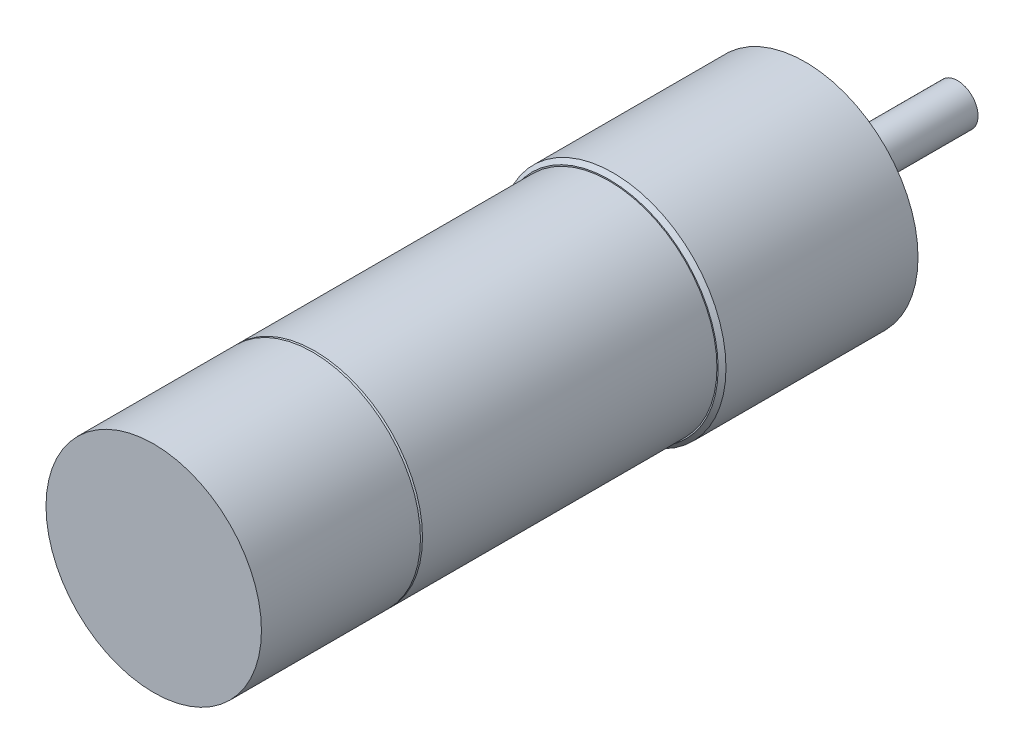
ISO-10303-21;
HEADER;
FILE_DESCRIPTION(('STEP AP214'),'2;1');
FILE_NAME('part.step','',(''),(''),'','','');
FILE_SCHEMA(('AUTOMOTIVE_DESIGN { 1 0 10303 214 1 1 1 1 }'));
ENDSEC;
DATA;
#1=APPLICATION_CONTEXT('core data for automotive mechanical design processes');
#2=APPLICATION_PROTOCOL_DEFINITION('international standard','automotive_design',2000,#1);
#3=PRODUCT_CONTEXT('',#1,'mechanical');
#4=PRODUCT('Part','Part','',(#3));
#5=PRODUCT_RELATED_PRODUCT_CATEGORY('part','',(#4));
#6=PRODUCT_DEFINITION_FORMATION('','',#4);
#7=PRODUCT_DEFINITION_CONTEXT('part definition',#1,'design');
#8=PRODUCT_DEFINITION('design','',#6,#7);
#9=PRODUCT_DEFINITION_SHAPE('','',#8);
#10=(LENGTH_UNIT() NAMED_UNIT(*) SI_UNIT(.MILLI.,.METRE.));
#11=(NAMED_UNIT(*) PLANE_ANGLE_UNIT() SI_UNIT($,.RADIAN.));
#12=(NAMED_UNIT(*) SI_UNIT($,.STERADIAN.) SOLID_ANGLE_UNIT());
#13=UNCERTAINTY_MEASURE_WITH_UNIT(LENGTH_MEASURE(1.E-05),#10,'distance_accuracy_value','');
#14=(GEOMETRIC_REPRESENTATION_CONTEXT(3) GLOBAL_UNCERTAINTY_ASSIGNED_CONTEXT((#13)) GLOBAL_UNIT_ASSIGNED_CONTEXT((#10,
#11,#12)) REPRESENTATION_CONTEXT('',''));
#15=CARTESIAN_POINT('',(0.,0.,0.));
#16=DIRECTION('',(0.,0.,1.));
#17=DIRECTION('',(1.,0.,0.));
#18=AXIS2_PLACEMENT_3D('',#15,#16,#17);
#19=CARTESIAN_POINT('',(0.,0.,-3.15));
#20=DIRECTION('',(0.,0.,1.));
#21=DIRECTION('',(1.,0.,0.));
#22=AXIS2_PLACEMENT_3D('',#19,#20,#21);
#23=CYLINDRICAL_SURFACE('',#22,5.);
#24=CARTESIAN_POINT('',(0.,0.,0.));
#25=DIRECTION('',(0.,0.,1.));
#26=DIRECTION('',(1.,0.,0.));
#27=AXIS2_PLACEMENT_3D('',#24,#25,#26);
#28=CIRCLE('',#27,5.);
#29=CARTESIAN_POINT('',(5.,0.,0.));
#30=VERTEX_POINT('',#29);
#31=EDGE_CURVE('E40',#30,#30,#28,.F.);
#32=ORIENTED_EDGE('',*,*,#31,.T.);
#33=EDGE_LOOP('',(#32));
#34=FACE_BOUND('',#33,.T.);
#35=CARTESIAN_POINT('',(0.,0.,-1.35));
#36=DIRECTION('',(0.,0.,-1.));
#37=DIRECTION('',(-1.,0.,0.));
#38=AXIS2_PLACEMENT_3D('',#35,#36,#37);
#39=CIRCLE('',#38,5.);
#40=CARTESIAN_POINT('',(-5.,0.,-1.35));
#41=VERTEX_POINT('',#40);
#42=EDGE_CURVE('E32',#41,#41,#39,.T.);
#43=ORIENTED_EDGE('',*,*,#42,.F.);
#44=EDGE_LOOP('',(#43));
#45=FACE_BOUND('',#44,.T.);
#46=ADVANCED_FACE('F28',(#34,#45),#23,.T.);
#47=CARTESIAN_POINT('',(0.,0.,0.));
#48=DIRECTION('',(0.,0.,1.));
#49=DIRECTION('',(1.,0.,0.));
#50=AXIS2_PLACEMENT_3D('',#47,#48,#49);
#51=PLANE('',#50);
#52=CARTESIAN_POINT('',(0.,0.,0.));
#53=DIRECTION('',(0.,0.,1.));
#54=DIRECTION('',(1.,0.,0.));
#55=AXIS2_PLACEMENT_3D('',#52,#53,#54);
#56=CIRCLE('',#55,11.);
#57=CARTESIAN_POINT('',(11.,0.,0.));
#58=VERTEX_POINT('',#57);
#59=EDGE_CURVE('E56',#58,#58,#56,.T.);
#60=ORIENTED_EDGE('',*,*,#59,.F.);
#61=EDGE_LOOP('',(#60));
#62=FACE_BOUND('',#61,.T.);
#63=ORIENTED_EDGE('',*,*,#31,.F.);
#64=EDGE_LOOP('',(#63));
#65=FACE_BOUND('',#64,.T.);
#66=ADVANCED_FACE('F95',(#62,#65),#51,.F.);
#67=CARTESIAN_POINT('',(0.,0.,19.1));
#68=DIRECTION('',(0.,0.,1.));
#69=DIRECTION('',(1.,0.,0.));
#70=AXIS2_PLACEMENT_3D('',#67,#68,#69);
#71=PLANE('',#70);
#72=CARTESIAN_POINT('',(0.,0.,19.1));
#73=DIRECTION('',(0.,0.,1.));
#74=DIRECTION('',(1.,0.,0.));
#75=AXIS2_PLACEMENT_3D('',#72,#73,#74);
#76=CIRCLE('',#75,10.619);
#77=CARTESIAN_POINT('',(10.619,0.,19.1));
#78=VERTEX_POINT('',#77);
#79=EDGE_CURVE('E53',#78,#78,#76,.T.);
#80=ORIENTED_EDGE('',*,*,#79,.T.);
#81=EDGE_LOOP('',(#80));
#82=FACE_BOUND('',#81,.T.);
#83=CARTESIAN_POINT('',(0.,0.,19.1));
#84=DIRECTION('',(0.,0.,1.));
#85=DIRECTION('',(1.,0.,0.));
#86=AXIS2_PLACEMENT_3D('',#83,#84,#85);
#87=CIRCLE('',#86,10.5);
#88=CARTESIAN_POINT('',(10.5,0.,19.1));
#89=VERTEX_POINT('',#88);
#90=EDGE_CURVE('E46',#89,#89,#87,.T.);
#91=ORIENTED_EDGE('',*,*,#90,.F.);
#92=EDGE_LOOP('',(#91));
#93=FACE_BOUND('',#92,.T.);
#94=ADVANCED_FACE('F101',(#82,#93),#71,.T.);
#95=CARTESIAN_POINT('',(0.,0.,19.1));
#96=DIRECTION('',(0.,0.,-1.));
#97=DIRECTION('',(-1.,0.,0.));
#98=AXIS2_PLACEMENT_3D('',#95,#96,#97);
#99=CYLINDRICAL_SURFACE('',#98,11.);
#100=CARTESIAN_POINT('',(0.,0.,18.719));
#101=DIRECTION('',(0.,0.,1.));
#102=DIRECTION('',(1.,0.,0.));
#103=AXIS2_PLACEMENT_3D('',#100,#101,#102);
#104=CIRCLE('',#103,11.);
#105=CARTESIAN_POINT('',(11.,0.,18.719));
#106=VERTEX_POINT('',#105);
#107=EDGE_CURVE('E50',#106,#106,#104,.F.);
#108=ORIENTED_EDGE('',*,*,#107,.T.);
#109=EDGE_LOOP('',(#108));
#110=FACE_BOUND('',#109,.T.);
#111=ORIENTED_EDGE('',*,*,#59,.T.);
#112=EDGE_LOOP('',(#111));
#113=FACE_BOUND('',#112,.T.);
#114=ADVANCED_FACE('F30',(#110,#113),#99,.T.);
#115=CARTESIAN_POINT('',(0.,0.,19.1));
#116=DIRECTION('',(0.,0.,-1.));
#117=DIRECTION('',(-1.,0.,0.));
#118=AXIS2_PLACEMENT_3D('',#115,#116,#117);
#119=CONICAL_SURFACE('',#118,10.619,0.785398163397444);
#120=ORIENTED_EDGE('',*,*,#107,.F.);
#121=EDGE_LOOP('',(#120));
#122=FACE_BOUND('',#121,.T.);
#123=ORIENTED_EDGE('',*,*,#79,.F.);
#124=EDGE_LOOP('',(#123));
#125=FACE_BOUND('',#124,.T.);
#126=ADVANCED_FACE('F112',(#122,#125),#119,.T.);
#127=CARTESIAN_POINT('',(0.,0.,48.));
#128=DIRECTION('',(0.,0.,-1.));
#129=DIRECTION('',(-1.,0.,0.));
#130=AXIS2_PLACEMENT_3D('',#127,#128,#129);
#131=CYLINDRICAL_SURFACE('',#130,10.5);
#132=CARTESIAN_POINT('',(0.,0.,47.8));
#133=DIRECTION('',(0.,0.,1.));
#134=DIRECTION('',(1.,0.,0.));
#135=AXIS2_PLACEMENT_3D('',#132,#133,#134);
#136=CIRCLE('',#135,10.5);
#137=CARTESIAN_POINT('',(10.5,0.,47.8));
#138=VERTEX_POINT('',#137);
#139=EDGE_CURVE('E10',#138,#138,#136,.F.);
#140=ORIENTED_EDGE('',*,*,#139,.T.);
#141=EDGE_LOOP('',(#140));
#142=FACE_BOUND('',#141,.T.);
#143=ORIENTED_EDGE('',*,*,#90,.T.);
#144=EDGE_LOOP('',(#143));
#145=FACE_BOUND('',#144,.T.);
#146=ADVANCED_FACE('F108',(#142,#145),#131,.T.);
#147=CARTESIAN_POINT('',(0.,0.,48.));
#148=DIRECTION('',(0.,0.,-1.));
#149=DIRECTION('',(-1.,0.,0.));
#150=AXIS2_PLACEMENT_3D('',#147,#148,#149);
#151=CONICAL_SURFACE('',#150,10.3,0.785398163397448);
#152=ORIENTED_EDGE('',*,*,#139,.F.);
#153=EDGE_LOOP('',(#152));
#154=FACE_BOUND('',#153,.T.);
#155=CARTESIAN_POINT('',(0.,0.,48.));
#156=DIRECTION('',(0.,0.,1.));
#157=DIRECTION('',(1.,0.,0.));
#158=AXIS2_PLACEMENT_3D('',#155,#156,#157);
#159=CIRCLE('',#158,10.3);
#160=CARTESIAN_POINT('',(10.3,0.,48.));
#161=VERTEX_POINT('',#160);
#162=EDGE_CURVE('E36',#161,#161,#159,.T.);
#163=ORIENTED_EDGE('',*,*,#162,.F.);
#164=EDGE_LOOP('',(#163));
#165=FACE_BOUND('',#164,.T.);
#166=ADVANCED_FACE('F111',(#154,#165),#151,.T.);
#167=CARTESIAN_POINT('',(0.,0.,63.5));
#168=DIRECTION('',(0.,0.,-1.));
#169=DIRECTION('',(-1.,0.,0.));
#170=AXIS2_PLACEMENT_3D('',#167,#168,#169);
#171=CYLINDRICAL_SURFACE('',#170,10.5);
#172=CARTESIAN_POINT('',(0.,0.,63.5));
#173=DIRECTION('',(0.,0.,1.));
#174=DIRECTION('',(1.,0.,0.));
#175=AXIS2_PLACEMENT_3D('',#172,#173,#174);
#176=CIRCLE('',#175,10.5);
#177=CARTESIAN_POINT('',(10.5,0.,63.5));
#178=VERTEX_POINT('',#177);
#179=EDGE_CURVE('E63',#178,#178,#176,.T.);
#180=ORIENTED_EDGE('',*,*,#179,.F.);
#181=EDGE_LOOP('',(#180));
#182=FACE_BOUND('',#181,.T.);
#183=CARTESIAN_POINT('',(0.,0.,48.));
#184=DIRECTION('',(0.,0.,1.));
#185=DIRECTION('',(1.,0.,0.));
#186=AXIS2_PLACEMENT_3D('',#183,#184,#185);
#187=CIRCLE('',#186,10.5);
#188=CARTESIAN_POINT('',(10.5,0.,48.));
#189=VERTEX_POINT('',#188);
#190=EDGE_CURVE('E66',#189,#189,#187,.T.);
#191=ORIENTED_EDGE('',*,*,#190,.T.);
#192=EDGE_LOOP('',(#191));
#193=FACE_BOUND('',#192,.T.);
#194=ADVANCED_FACE('F148',(#182,#193),#171,.T.);
#195=CARTESIAN_POINT('',(0.,0.,63.5));
#196=DIRECTION('',(0.,0.,1.));
#197=DIRECTION('',(1.,0.,0.));
#198=AXIS2_PLACEMENT_3D('',#195,#196,#197);
#199=PLANE('',#198);
#200=ORIENTED_EDGE('',*,*,#179,.T.);
#201=EDGE_LOOP('',(#200));
#202=FACE_BOUND('',#201,.T.);
#203=ADVANCED_FACE('F156',(#202),#199,.T.);
#204=CARTESIAN_POINT('',(0.,0.,48.));
#205=DIRECTION('',(0.,0.,1.));
#206=DIRECTION('',(1.,0.,0.));
#207=AXIS2_PLACEMENT_3D('',#204,#205,#206);
#208=PLANE('',#207);
#209=ORIENTED_EDGE('',*,*,#162,.T.);
#210=EDGE_LOOP('',(#209));
#211=FACE_BOUND('',#210,.T.);
#212=ORIENTED_EDGE('',*,*,#190,.F.);
#213=EDGE_LOOP('',(#212));
#214=FACE_BOUND('',#213,.T.);
#215=ADVANCED_FACE('F91',(#211,#214),#208,.F.);
#216=CARTESIAN_POINT('',(0.,0.,-1.35));
#217=DIRECTION('',(0.,0.,-1.));
#218=DIRECTION('',(-1.,0.,0.));
#219=AXIS2_PLACEMENT_3D('',#216,#217,#218);
#220=PLANE('',#219);
#221=CARTESIAN_POINT('',(0.,0.,-1.35));
#222=DIRECTION('',(0.,0.,-1.));
#223=DIRECTION('',(-1.,0.,0.));
#224=AXIS2_PLACEMENT_3D('',#221,#222,#223);
#225=CIRCLE('',#224,3.5);
#226=CARTESIAN_POINT('',(-3.5,0.,-1.35));
#227=VERTEX_POINT('',#226);
#228=EDGE_CURVE('E69',#227,#227,#225,.T.);
#229=ORIENTED_EDGE('',*,*,#228,.F.);
#230=EDGE_LOOP('',(#229));
#231=FACE_BOUND('',#230,.T.);
#232=ORIENTED_EDGE('',*,*,#42,.T.);
#233=EDGE_LOOP('',(#232));
#234=FACE_BOUND('',#233,.T.);
#235=ADVANCED_FACE('F81',(#231,#234),#220,.T.);
#236=CARTESIAN_POINT('',(0.,0.,-1.35));
#237=DIRECTION('',(0.,0.,-1.));
#238=DIRECTION('',(-1.,0.,0.));
#239=AXIS2_PLACEMENT_3D('',#236,#237,#238);
#240=CYLINDRICAL_SURFACE('',#239,3.5);
#241=ORIENTED_EDGE('',*,*,#228,.T.);
#242=EDGE_LOOP('',(#241));
#243=FACE_BOUND('',#242,.T.);
#244=CARTESIAN_POINT('',(0.,0.,-3.15));
#245=DIRECTION('',(0.,0.,-1.));
#246=DIRECTION('',(-1.,0.,0.));
#247=AXIS2_PLACEMENT_3D('',#244,#245,#246);
#248=CIRCLE('',#247,3.5);
#249=CARTESIAN_POINT('',(-3.5,0.,-3.15));
#250=VERTEX_POINT('',#249);
#251=EDGE_CURVE('E72',#250,#250,#248,.T.);
#252=ORIENTED_EDGE('',*,*,#251,.F.);
#253=EDGE_LOOP('',(#252));
#254=FACE_BOUND('',#253,.T.);
#255=ADVANCED_FACE('F78',(#243,#254),#240,.T.);
#256=CARTESIAN_POINT('',(0.,0.,-14.85));
#257=DIRECTION('',(0.,0.,-1.));
#258=DIRECTION('',(-1.,0.,0.));
#259=AXIS2_PLACEMENT_3D('',#256,#257,#258);
#260=PLANE('',#259);
#261=CARTESIAN_POINT('',(0.,0.,-14.85));
#262=DIRECTION('',(0.,0.,-1.));
#263=DIRECTION('',(-1.,0.,0.));
#264=AXIS2_PLACEMENT_3D('',#261,#262,#263);
#265=CIRCLE('',#264,2.);
#266=CARTESIAN_POINT('',(-2.,0.,-14.85));
#267=VERTEX_POINT('',#266);
#268=EDGE_CURVE('E47',#267,#267,#265,.T.);
#269=ORIENTED_EDGE('',*,*,#268,.T.);
#270=EDGE_LOOP('',(#269));
#271=FACE_BOUND('',#270,.T.);
#272=ADVANCED_FACE('F80',(#271),#260,.T.);
#273=CARTESIAN_POINT('',(0.,0.,-14.85));
#274=DIRECTION('',(0.,0.,1.));
#275=DIRECTION('',(1.,0.,0.));
#276=AXIS2_PLACEMENT_3D('',#273,#274,#275);
#277=CYLINDRICAL_SURFACE('',#276,2.);
#278=CARTESIAN_POINT('',(0.,0.,-3.15));
#279=DIRECTION('',(0.,0.,-1.));
#280=DIRECTION('',(-1.,0.,0.));
#281=AXIS2_PLACEMENT_3D('',#278,#279,#280);
#282=CIRCLE('',#281,2.);
#283=CARTESIAN_POINT('',(-2.,0.,-3.15));
#284=VERTEX_POINT('',#283);
#285=EDGE_CURVE('E43',#284,#284,#282,.F.);
#286=ORIENTED_EDGE('',*,*,#285,.F.);
#287=EDGE_LOOP('',(#286));
#288=FACE_BOUND('',#287,.T.);
#289=ORIENTED_EDGE('',*,*,#268,.F.);
#290=EDGE_LOOP('',(#289));
#291=FACE_BOUND('',#290,.T.);
#292=ADVANCED_FACE('F88',(#288,#291),#277,.T.);
#293=CARTESIAN_POINT('',(0.,0.,-3.15));
#294=DIRECTION('',(0.,0.,-1.));
#295=DIRECTION('',(-1.,0.,0.));
#296=AXIS2_PLACEMENT_3D('',#293,#294,#295);
#297=PLANE('',#296);
#298=ORIENTED_EDGE('',*,*,#285,.T.);
#299=EDGE_LOOP('',(#298));
#300=FACE_BOUND('',#299,.T.);
#301=ORIENTED_EDGE('',*,*,#251,.T.);
#302=EDGE_LOOP('',(#301));
#303=FACE_BOUND('',#302,.T.);
#304=ADVANCED_FACE('F76',(#300,#303),#297,.T.);
#305=CLOSED_SHELL('',(#46,#66,#94,#114,#126,#146,#166,#194,#203,#215,#235,#255,#272,#292,#304));
#306=MANIFOLD_SOLID_BREP('B2',#305);
#307=ADVANCED_BREP_SHAPE_REPRESENTATION('',(#18,#306),#14);
#308=SHAPE_DEFINITION_REPRESENTATION(#9,#307);
ENDSEC;
END-ISO-10303-21;
